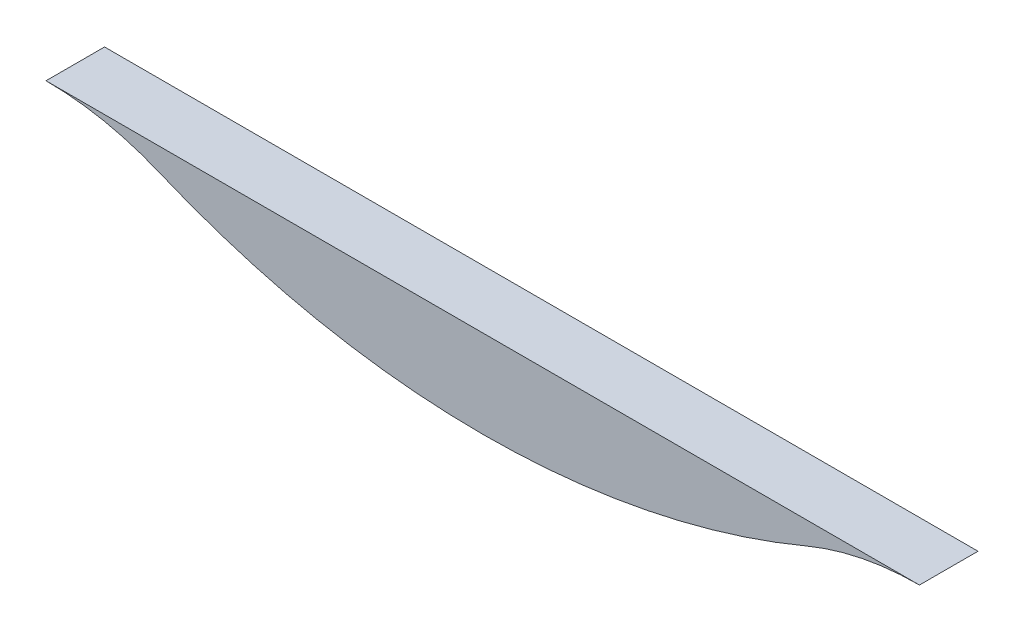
ISO-10303-21;
HEADER;
FILE_DESCRIPTION(('STEP AP214'),'2;1');
FILE_NAME('part.step','',(''),(''),'','','');
FILE_SCHEMA(('AUTOMOTIVE_DESIGN { 1 0 10303 214 1 1 1 1 }'));
ENDSEC;
DATA;
#1=APPLICATION_CONTEXT('core data for automotive mechanical design processes');
#2=APPLICATION_PROTOCOL_DEFINITION('international standard','automotive_design',2000,#1);
#3=PRODUCT_CONTEXT('',#1,'mechanical');
#4=PRODUCT('Part','Part','',(#3));
#5=PRODUCT_RELATED_PRODUCT_CATEGORY('part','',(#4));
#6=PRODUCT_DEFINITION_FORMATION('','',#4);
#7=PRODUCT_DEFINITION_CONTEXT('part definition',#1,'design');
#8=PRODUCT_DEFINITION('design','',#6,#7);
#9=PRODUCT_DEFINITION_SHAPE('','',#8);
#10=(LENGTH_UNIT() NAMED_UNIT(*) SI_UNIT(.MILLI.,.METRE.));
#11=(NAMED_UNIT(*) PLANE_ANGLE_UNIT() SI_UNIT($,.RADIAN.));
#12=(NAMED_UNIT(*) SI_UNIT($,.STERADIAN.) SOLID_ANGLE_UNIT());
#13=UNCERTAINTY_MEASURE_WITH_UNIT(LENGTH_MEASURE(1.E-05),#10,'distance_accuracy_value','');
#14=(GEOMETRIC_REPRESENTATION_CONTEXT(3) GLOBAL_UNCERTAINTY_ASSIGNED_CONTEXT((#13)) GLOBAL_UNIT_ASSIGNED_CONTEXT((#10,
#11,#12)) REPRESENTATION_CONTEXT('',''));
#15=CARTESIAN_POINT('',(0.,0.,0.));
#16=DIRECTION('',(0.,0.,1.));
#17=DIRECTION('',(1.,0.,0.));
#18=AXIS2_PLACEMENT_3D('',#15,#16,#17);
#19=CARTESIAN_POINT('',(0.,25.59375,1.));
#20=DIRECTION('',(0.,0.,-1.));
#21=DIRECTION('',(-1.,0.,0.));
#22=AXIS2_PLACEMENT_3D('',#19,#20,#21);
#23=CYLINDRICAL_SURFACE('',#22,28.59375);
#24=CARTESIAN_POINT('',(0.,25.59375,-1.));
#25=DIRECTION('',(0.,0.,1.));
#26=DIRECTION('',(1.,0.,0.));
#27=AXIS2_PLACEMENT_3D('',#24,#25,#26);
#28=CIRCLE('',#27,28.59375);
#29=CARTESIAN_POINT('',(-11.0529990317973,-0.777327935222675,-1.));
#30=VERTEX_POINT('',#29);
#31=CARTESIAN_POINT('',(11.0529990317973,-0.777327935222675,-1.));
#32=VERTEX_POINT('',#31);
#33=EDGE_CURVE('E105',#30,#32,#28,.T.);
#34=ORIENTED_EDGE('',*,*,#33,.T.);
#35=DIRECTION('',(0.,0.,-1.));
#36=VECTOR('',#35,1.);
#37=CARTESIAN_POINT('',(11.0529990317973,-0.777327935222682,1.));
#38=LINE('',#37,#36);
#39=CARTESIAN_POINT('',(11.0529990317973,-0.777327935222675,1.));
#40=VERTEX_POINT('',#39);
#41=EDGE_CURVE('E50',#32,#40,#38,.F.);
#42=ORIENTED_EDGE('',*,*,#41,.T.);
#43=CARTESIAN_POINT('',(0.,25.59375,1.));
#44=DIRECTION('',(0.,0.,1.));
#45=DIRECTION('',(1.,0.,0.));
#46=AXIS2_PLACEMENT_3D('',#43,#44,#45);
#47=CIRCLE('',#46,28.59375);
#48=CARTESIAN_POINT('',(-11.0529990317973,-0.777327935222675,1.));
#49=VERTEX_POINT('',#48);
#50=EDGE_CURVE('E89',#49,#40,#47,.T.);
#51=ORIENTED_EDGE('',*,*,#50,.F.);
#52=DIRECTION('',(0.,0.,-1.));
#53=VECTOR('',#52,1.);
#54=CARTESIAN_POINT('',(-11.0529990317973,-0.777327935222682,1.));
#55=LINE('',#54,#53);
#56=EDGE_CURVE('E94',#49,#30,#55,.T.);
#57=ORIENTED_EDGE('',*,*,#56,.T.);
#58=EDGE_LOOP('',(#34,#42,#51,#57));
#59=FACE_BOUND('',#58,.T.);
#60=ADVANCED_FACE('F36',(#59),#23,.T.);
#61=CARTESIAN_POINT('',(0.,25.59375,1.));
#62=DIRECTION('',(0.,0.,1.));
#63=DIRECTION('',(1.,0.,0.));
#64=AXIS2_PLACEMENT_3D('',#61,#62,#63);
#65=PLANE('',#64);
#66=DIRECTION('',(1.,0.,0.));
#67=VECTOR('',#66,1.);
#68=CARTESIAN_POINT('',(-12.75,0.,1.));
#69=LINE('',#68,#67);
#70=CARTESIAN_POINT('',(-14.9185287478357,0.,1.));
#71=VERTEX_POINT('',#70);
#72=CARTESIAN_POINT('',(14.9185287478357,0.,1.));
#73=VERTEX_POINT('',#72);
#74=EDGE_CURVE('E77',#71,#73,#69,.T.);
#75=ORIENTED_EDGE('',*,*,#74,.F.);
#76=CARTESIAN_POINT('',(-14.9185287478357,-10.,1.));
#77=DIRECTION('',(0.,0.,1.));
#78=DIRECTION('',(1.,0.,0.));
#79=AXIS2_PLACEMENT_3D('',#76,#77,#78);
#80=CIRCLE('',#79,10.);
#81=EDGE_CURVE('E11',#71,#49,#80,.F.);
#82=ORIENTED_EDGE('',*,*,#81,.T.);
#83=ORIENTED_EDGE('',*,*,#50,.T.);
#84=CARTESIAN_POINT('',(14.9185287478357,-10.,1.));
#85=DIRECTION('',(0.,0.,1.));
#86=DIRECTION('',(1.,0.,0.));
#87=AXIS2_PLACEMENT_3D('',#84,#85,#86);
#88=CIRCLE('',#87,10.);
#89=EDGE_CURVE('E87',#40,#73,#88,.F.);
#90=ORIENTED_EDGE('',*,*,#89,.T.);
#91=EDGE_LOOP('',(#75,#82,#83,#90));
#92=FACE_BOUND('',#91,.T.);
#93=ADVANCED_FACE('F85',(#92),#65,.T.);
#94=CARTESIAN_POINT('',(0.,25.59375,-1.));
#95=DIRECTION('',(0.,0.,1.));
#96=DIRECTION('',(1.,0.,0.));
#97=AXIS2_PLACEMENT_3D('',#94,#95,#96);
#98=PLANE('',#97);
#99=ORIENTED_EDGE('',*,*,#33,.F.);
#100=CARTESIAN_POINT('',(-14.9185287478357,-10.,-1.));
#101=DIRECTION('',(0.,0.,1.));
#102=DIRECTION('',(1.,0.,0.));
#103=AXIS2_PLACEMENT_3D('',#100,#101,#102);
#104=CIRCLE('',#103,10.);
#105=CARTESIAN_POINT('',(-14.9185287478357,0.,-1.));
#106=VERTEX_POINT('',#105);
#107=EDGE_CURVE('E43',#30,#106,#104,.T.);
#108=ORIENTED_EDGE('',*,*,#107,.T.);
#109=DIRECTION('',(1.,0.,0.));
#110=VECTOR('',#109,1.);
#111=CARTESIAN_POINT('',(-12.75,0.,-1.));
#112=LINE('',#111,#110);
#113=CARTESIAN_POINT('',(14.9185287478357,0.,-1.));
#114=VERTEX_POINT('',#113);
#115=EDGE_CURVE('E80',#106,#114,#112,.T.);
#116=ORIENTED_EDGE('',*,*,#115,.T.);
#117=CARTESIAN_POINT('',(14.9185287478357,-10.,-1.));
#118=DIRECTION('',(0.,0.,1.));
#119=DIRECTION('',(1.,0.,0.));
#120=AXIS2_PLACEMENT_3D('',#117,#118,#119);
#121=CIRCLE('',#120,10.);
#122=EDGE_CURVE('E97',#114,#32,#121,.T.);
#123=ORIENTED_EDGE('',*,*,#122,.T.);
#124=EDGE_LOOP('',(#99,#108,#116,#123));
#125=FACE_BOUND('',#124,.T.);
#126=ADVANCED_FACE('F103',(#125),#98,.F.);
#127=CARTESIAN_POINT('',(14.9185287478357,-10.,1.));
#128=DIRECTION('',(0.,0.,-1.));
#129=DIRECTION('',(-1.,0.,0.));
#130=AXIS2_PLACEMENT_3D('',#127,#128,#129);
#131=CYLINDRICAL_SURFACE('',#130,10.);
#132=ORIENTED_EDGE('',*,*,#89,.F.);
#133=ORIENTED_EDGE('',*,*,#41,.F.);
#134=ORIENTED_EDGE('',*,*,#122,.F.);
#135=DIRECTION('',(0.,0.,1.));
#136=VECTOR('',#135,1.);
#137=CARTESIAN_POINT('',(14.9185287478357,0.,-1.));
#138=LINE('',#137,#136);
#139=EDGE_CURVE('E83',#73,#114,#138,.F.);
#140=ORIENTED_EDGE('',*,*,#139,.F.);
#141=EDGE_LOOP('',(#132,#133,#134,#140));
#142=FACE_BOUND('',#141,.T.);
#143=ADVANCED_FACE('F110',(#142),#131,.F.);
#144=CARTESIAN_POINT('',(-14.9185287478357,-10.,1.));
#145=DIRECTION('',(0.,0.,-1.));
#146=DIRECTION('',(-1.,0.,0.));
#147=AXIS2_PLACEMENT_3D('',#144,#145,#146);
#148=CYLINDRICAL_SURFACE('',#147,10.);
#149=ORIENTED_EDGE('',*,*,#81,.F.);
#150=DIRECTION('',(0.,0.,1.));
#151=VECTOR('',#150,1.);
#152=CARTESIAN_POINT('',(-14.9185287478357,0.,1.));
#153=LINE('',#152,#151);
#154=EDGE_CURVE('E75',#106,#71,#153,.T.);
#155=ORIENTED_EDGE('',*,*,#154,.F.);
#156=ORIENTED_EDGE('',*,*,#107,.F.);
#157=ORIENTED_EDGE('',*,*,#56,.F.);
#158=EDGE_LOOP('',(#149,#155,#156,#157));
#159=FACE_BOUND('',#158,.T.);
#160=ADVANCED_FACE('F92',(#159),#148,.F.);
#161=CARTESIAN_POINT('',(-43.4634171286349,0.,20.));
#162=DIRECTION('',(0.,-1.,0.));
#163=DIRECTION('',(0.,0.,-1.));
#164=AXIS2_PLACEMENT_3D('',#161,#162,#163);
#165=PLANE('',#164);
#166=ORIENTED_EDGE('',*,*,#115,.F.);
#167=ORIENTED_EDGE('',*,*,#154,.T.);
#168=ORIENTED_EDGE('',*,*,#74,.T.);
#169=ORIENTED_EDGE('',*,*,#139,.T.);
#170=EDGE_LOOP('',(#166,#167,#168,#169));
#171=FACE_BOUND('',#170,.T.);
#172=ADVANCED_FACE('F76',(#171),#165,.F.);
#173=CLOSED_SHELL('',(#60,#93,#126,#143,#160,#172));
#174=MANIFOLD_SOLID_BREP('B2',#173);
#175=ADVANCED_BREP_SHAPE_REPRESENTATION('',(#18,#174),#14);
#176=SHAPE_DEFINITION_REPRESENTATION(#9,#175);
ENDSEC;
END-ISO-10303-21;
